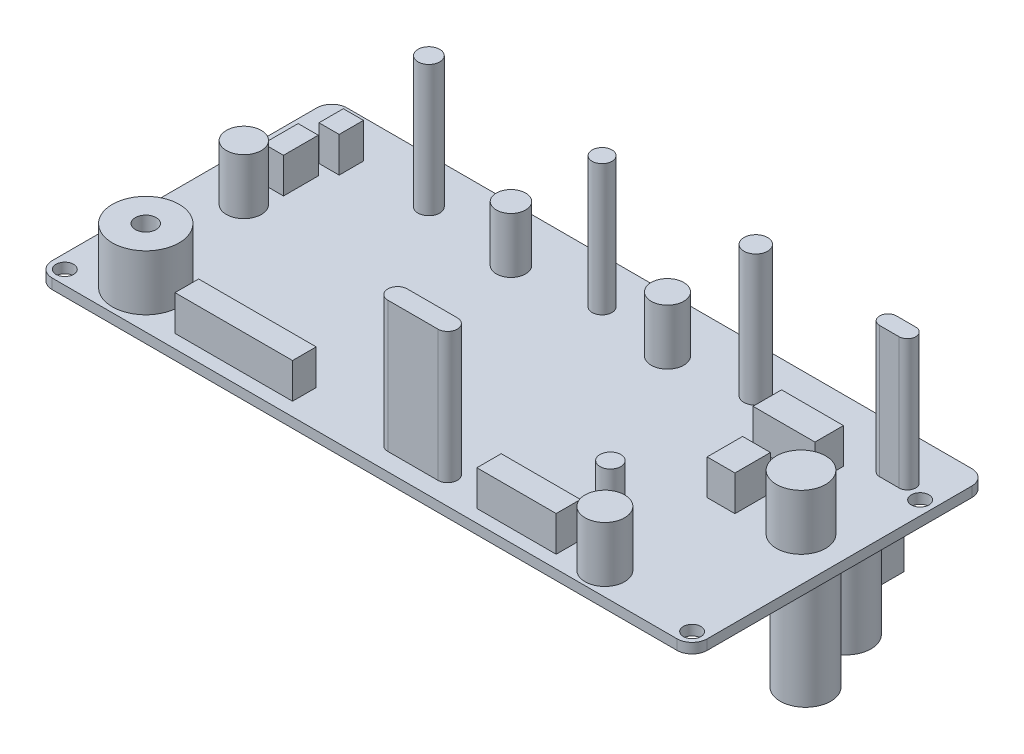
from build123d import *

# Parameters (mm, degrees)
ESQUISSE1_W             = 130
ESQUISSE1_H             = 58.5
CARTE_DEPTH             = 2
ESQUISSE2_W             = 4.00364543
ESQUISSE2_H             = 4.831985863
ESQUISSE2_W_2           = 4.003645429
ESQUISSE2_H_2           = 6.902836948
ESQUISSE2_W_3           = 23.331588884
ESQUISSE2_H_3           = 4.693929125
ESQUISSE2_W_4           = 15.73846824
ESQUISSE2_H_4           = 4.831985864
ESQUISSE2_W_5           = 5.522269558
ESQUISSE2_H_5           = 7.040893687
ESQUISSE2_W_6           = 12.287049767
ESQUISSE2_H_6           = 5.660326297
CONNECTEURS_DEPTH       = 7
ESQUISSE3_R             = 4.896637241
ESQUISSE3_R_2           = 3.929163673
ESQUISSE3_R_3           = 6.62672347
ESQUISSE3_R_4           = 2.070851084
ESQUISSE3_R_5           = 3.465884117
ESQUISSE3_R_6           = 2.912310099
ESQUISSE3_R_7           = 3.234772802
CONDOS_DEPTH            = 11
ESQUISSE4_R             = 2.160929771
ESQUISSE4_R_2           = 1.962154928
ESQUISSE4_R_3           = 2.351021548
CABLES_DEPTH            = 26
ESQUISSE5_R             = 5
ESQUISSE5_W             = 96
ESQUISSE5_H             = 12
BOSS_EXTRU_5_DEPTH      = 22
CAPTEUR_START           = -45
CAPTEUR_DEPTH           = 5
CAPTEUR2_START          = 45
CAPTEUR2_DEPTH          = 5
ESQUISSE8_R             = 1.75
ENL_V_MAT_EXTRU_1_DEPTH = 76.872013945
CONG_1_R                = 3
ESQUISSE9_W             = 77
ESQUISSE9_H             = 3
BOSS_EXTRU_8_DEPTH      = 2


with BuildPart() as part:
    # Esquisse1 → carte (new body)
    with BuildSketch(Plane(origin=(0, 0, 0), x_dir=(1, 0, 0), z_dir=(0, 1, 0))):
        Rectangle(ESQUISSE1_W, ESQUISSE1_H)
    extrude(amount=CARTE_DEPTH)

    # Esquisse2 → connecteurs (add)
    with BuildSketch(Plane(origin=(0, 2, 0), x_dir=(1, 0, 0), z_dir=(0, 1, 0))):
        with Locations((-53.220872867, 19.327943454)):
            Rectangle(ESQUISSE2_W, ESQUISSE2_H)
        with Locations((-55.153667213, 11.251624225)):
            Rectangle(ESQUISSE2_W_2, ESQUISSE2_H_2)
        with Locations((-28.646773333, -24.228957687)):
            Rectangle(ESQUISSE2_W_3, ESQUISSE2_H_3)
        with Locations((27.611347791, -24.297986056)):
            Rectangle(ESQUISSE2_W_4, ESQUISSE2_H_4)
        with Locations((43.487872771, 1.518624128)):
            Rectangle(ESQUISSE2_W_5, ESQUISSE2_H_5)
        with Locations((42.728560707, 14.081787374)):
            Rectangle(ESQUISSE2_W_6, ESQUISSE2_H_6)
    extrude(amount=CONNECTEURS_DEPTH)

    # Esquisse3 → condos (add)
    # profile 1 of 7: a face of its own
    with BuildSketch(Plane(origin=(0, 2, 0), x_dir=(1, 0, 0), z_dir=(0, 1, 0))):
        with Locations(Location((56.327149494, 1.035425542, 0), (0, 0, 270))):
            Circle(ESQUISSE3_R)
    # profile 2 of 7: a face of its own
    with BuildSketch(Plane(origin=(0, 2, 0), x_dir=(1, 0, 0), z_dir=(0, 1, 0))):
        with Locations(Location((43.073702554, -24.643127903, 0), (0, 0, 270))):
            Circle(ESQUISSE3_R_2)
    # profile 3 of 7: a face of its own
    with BuildSketch(Plane(origin=(0, 2, 0), x_dir=(1, 0, 0), z_dir=(0, 1, 0))):
        with Locations(Location((-51.080993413, -21.605879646, 0), (0, 0, 270))):
            Circle(ESQUISSE3_R_3)
        with Locations(Location((-51.080993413, -21.605879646, 0), (0, 0, 270))):
            Circle(ESQUISSE3_R_4, mode=Mode.SUBTRACT)
    # profile 4 of 7: a face of its own
    with BuildSketch(Plane(origin=(0, 2, 0), x_dir=(1, 0, 0), z_dir=(0, 1, 0))):
        with Locations(Location((-55.636865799, 2.415992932, 0), (0, 0, 270))):
            Circle(ESQUISSE3_R_5)
    # profile 5 of 7: a face of its own
    with BuildSketch(Plane(origin=(0, 2, 0), x_dir=(1, 0, 0), z_dir=(0, 1, 0))):
        with Locations(Location((-18.637659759, 18.43057465, 0), (0, 0, 270))):
            Circle(ESQUISSE3_R_6)
    # profile 6 of 7: a face of its own
    with BuildSketch(Plane(origin=(0, 2, 0), x_dir=(1, 0, 0), z_dir=(0, 1, 0))):
        with Locations(Location((12.425106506, 18.43057465, 0), (0, 0, 270))):
            Circle(ESQUISSE3_R_7)
    # profile 7 of 7: a face of its own
    with BuildSketch(Plane(origin=(0, 2, 0), x_dir=(1, 0, 0), z_dir=(0, 1, 0))):
        with Locations(Location((35.756695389, -16.221666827, 0), (0, 0, 270))):
            Circle(ESQUISSE3_R_4)
    extrude(amount=CONDOS_DEPTH)

    # Esquisse4 → cables (add)
    with BuildSketch(Plane(origin=(0, 2, 0), x_dir=(1, 0, 0), z_dir=(0, 1, 0))):
        with Locations(Location((-36.861149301, 20.363368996, 0), (0, 0, 270))):
            Circle(ESQUISSE4_R)
        with Locations(Location((-2.485021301, 20.363368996, 0), (0, 0, 270))):
            Circle(ESQUISSE4_R_2)
        with Locations(Location((28.025518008, 20.363368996, 0), (0, 0, 270))):
            Circle(ESQUISSE4_R_3)
        with BuildLine():
            Line((54.256298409, 22.020049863), (58.1218871, 22.020049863))
            ThreePointArc((58.1218871, 22.020049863), (59.778567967, 20.363368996), (58.1218871, 18.706688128))
            Line((58.1218871, 18.706688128), (54.256298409, 18.706688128))
            ThreePointArc((54.256298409, 18.706688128), (52.599617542, 20.363368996), (54.256298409, 22.020049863))
        make_face()
        with BuildLine():
            Line((1.104453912, -21.881993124), (11.044539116, -21.881993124))
            ThreePointArc((11.044539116, -21.881993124), (12.977333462, -23.81478747), (11.044539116, -25.747581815))
            Line((11.044539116, -25.747581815), (1.104453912, -25.747581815))
            ThreePointArc((1.104453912, -25.747581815), (-0.828340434, -23.81478747), (1.104453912, -21.881993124))
        make_face()
    extrude(amount=CABLES_DEPTH)

    # Esquisse5 → Boss.-Extru.5 (add)
    with BuildSketch(Plane.XZ):
        with Locations(Location((59, 0.75, 0), (0, 0, 90))):
            Circle(ESQUISSE5_R)
        with Locations(Location((54, -12.25, 0), (0, 0, 90))):
            Circle(ESQUISSE5_R)
        with Locations((1, -22.75)):
            Rectangle(ESQUISSE5_W, ESQUISSE5_H)
    extrude(amount=BOSS_EXTRU_5_DEPTH)

    # Esquisse7 → capteur (add)
    with BuildSketch(Plane(origin=(0, 0, 0), x_dir=(0, 0, -1), z_dir=(1, 0, 0)).offset(CAPTEUR_START)):
        Polygon((3.25, 0), (-9.75, 0), (-9.75, -10.3), (-5.75, -10.3), (-5.75, -2.3), (-0.75, -2.3), (-0.75, -10.3), (3.25, -10.3), align=None)
    extrude(amount=-CAPTEUR_DEPTH)

    # Esquisse7_2 → capteur2 (add)
    with BuildSketch(Plane(origin=(0, 0, 0), x_dir=(0, 0, -1), z_dir=(1, 0, 0)).offset(CAPTEUR2_START)):
        Polygon((3.25, 0), (-9.75, 0), (-9.75, -10.3), (-5.75, -10.3), (-5.75, -2.3), (-0.75, -2.3), (-0.75, -10.3), (3.25, -10.3), align=None)
    extrude(amount=CAPTEUR2_DEPTH)

    # Esquisse8 → Enl_v. mat.-Extru.1 (cut, through all)
    with BuildSketch(Plane(origin=(0, 2, 0), x_dir=(1, 0, 0), z_dir=(0, 1, 0))):
        with Locations(Location((-62.25, 18.75, 0), (0, 0, 270))):
            Circle(ESQUISSE8_R)
        with Locations(Location((62.25, 18.75, 0), (0, 0, 270))):
            Circle(ESQUISSE8_R)
        with Locations(Location((62.25, -26.5, 0), (0, 0, 270))):
            Circle(ESQUISSE8_R)
        with Locations(Location((-62.25, -26.5, 0), (0, 0, 270))):
            Circle(ESQUISSE8_R)
    extrude(amount=-ENL_V_MAT_EXTRU_1_DEPTH, mode=Mode.SUBTRACT)

    # Cong_1
    cong_1_edges = [part.edges().sort_by_distance(p)[0] for p in [
        (-65, 1, -29.25),
        (65, 1, -29.25),
        (65, 1, 29.25),
        (-65, 1, 29.25),
    ]]
    fillet(cong_1_edges, radius=CONG_1_R)

    # Esquisse9 → Boss.-Extru.8 (add)
    with BuildSketch(Plane.XZ):
        with Locations((1.5, 23.75)):
            Rectangle(ESQUISSE9_W, ESQUISSE9_H)
    extrude(amount=BOSS_EXTRU_8_DEPTH)


solid = part.part
